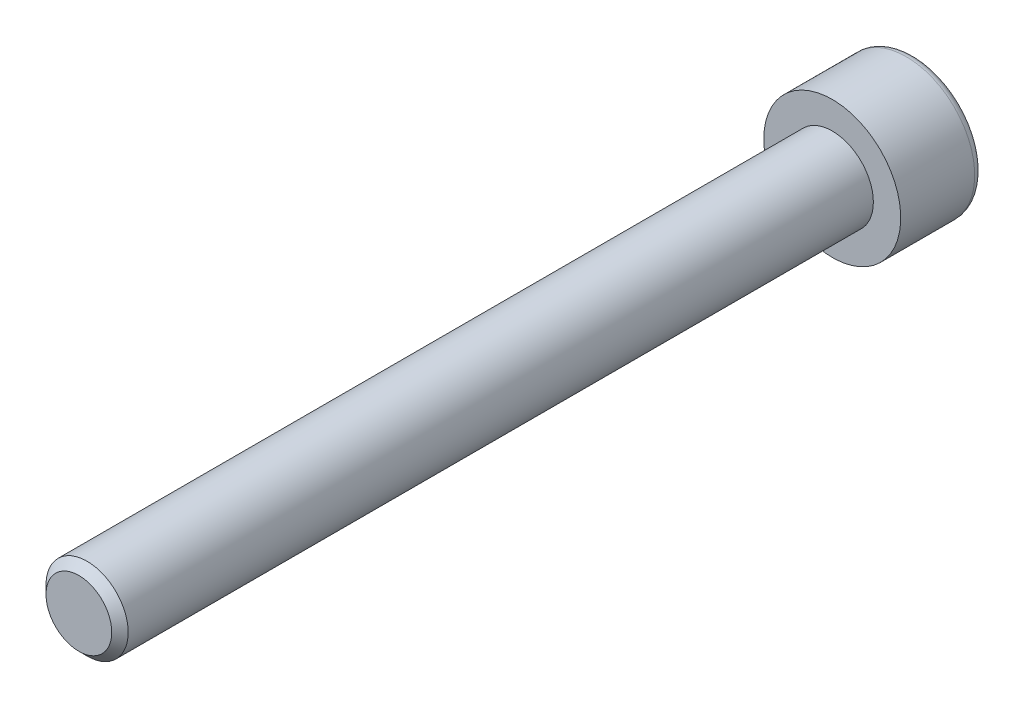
ISO-10303-21;
HEADER;
FILE_DESCRIPTION(('STEP AP214'),'2;1');
FILE_NAME('part.step','',(''),(''),'','','');
FILE_SCHEMA(('AUTOMOTIVE_DESIGN { 1 0 10303 214 1 1 1 1 }'));
ENDSEC;
DATA;
#1=APPLICATION_CONTEXT('core data for automotive mechanical design processes');
#2=APPLICATION_PROTOCOL_DEFINITION('international standard','automotive_design',2000,#1);
#3=PRODUCT_CONTEXT('',#1,'mechanical');
#4=PRODUCT('Part','Part','',(#3));
#5=PRODUCT_RELATED_PRODUCT_CATEGORY('part','',(#4));
#6=PRODUCT_DEFINITION_FORMATION('','',#4);
#7=PRODUCT_DEFINITION_CONTEXT('part definition',#1,'design');
#8=PRODUCT_DEFINITION('design','',#6,#7);
#9=PRODUCT_DEFINITION_SHAPE('','',#8);
#10=(LENGTH_UNIT() NAMED_UNIT(*) SI_UNIT(.MILLI.,.METRE.));
#11=(NAMED_UNIT(*) PLANE_ANGLE_UNIT() SI_UNIT($,.RADIAN.));
#12=(NAMED_UNIT(*) SI_UNIT($,.STERADIAN.) SOLID_ANGLE_UNIT());
#13=UNCERTAINTY_MEASURE_WITH_UNIT(LENGTH_MEASURE(1.E-05),#10,'distance_accuracy_value','');
#14=(GEOMETRIC_REPRESENTATION_CONTEXT(3) GLOBAL_UNCERTAINTY_ASSIGNED_CONTEXT((#13)) GLOBAL_UNIT_ASSIGNED_CONTEXT((#10,
#11,#12)) REPRESENTATION_CONTEXT('',''));
#15=CARTESIAN_POINT('',(0.,0.,0.));
#16=DIRECTION('',(0.,0.,1.));
#17=DIRECTION('',(1.,0.,0.));
#18=AXIS2_PLACEMENT_3D('',#15,#16,#17);
#19=CARTESIAN_POINT('',(0.,0.,-6.));
#20=DIRECTION('',(0.,0.,1.));
#21=DIRECTION('',(1.,0.,0.));
#22=AXIS2_PLACEMENT_3D('',#19,#20,#21);
#23=PLANE('',#22);
#24=CARTESIAN_POINT('',(0.,0.,-6.));
#25=DIRECTION('',(0.,0.,-1.));
#26=DIRECTION('',(-1.,0.,0.));
#27=AXIS2_PLACEMENT_3D('',#24,#25,#26);
#28=CIRCLE('',#27,4.4);
#29=CARTESIAN_POINT('',(-4.4,0.,-6.));
#30=VERTEX_POINT('',#29);
#31=EDGE_CURVE('E140',#30,#30,#28,.T.);
#32=ORIENTED_EDGE('',*,*,#31,.T.);
#33=EDGE_LOOP('',(#32));
#34=FACE_BOUND('',#33,.T.);
#35=DIRECTION('',(-0.86602540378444,0.499999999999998,0.));
#36=VECTOR('',#35,1.);
#37=CARTESIAN_POINT('',(0.,2.88675134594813,-6.));
#38=LINE('',#37,#36);
#39=CARTESIAN_POINT('',(2.5,1.44337567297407,-6.));
#40=VERTEX_POINT('',#39);
#41=CARTESIAN_POINT('',(0.,2.88675134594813,-6.));
#42=VERTEX_POINT('',#41);
#43=EDGE_CURVE('E44',#40,#42,#38,.T.);
#44=ORIENTED_EDGE('',*,*,#43,.T.);
#45=DIRECTION('',(-0.866025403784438,-0.500000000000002,0.));
#46=VECTOR('',#45,1.);
#47=CARTESIAN_POINT('',(0.,2.88675134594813,-6.));
#48=LINE('',#47,#46);
#49=CARTESIAN_POINT('',(-2.5,1.44337567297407,-6.));
#50=VERTEX_POINT('',#49);
#51=EDGE_CURVE('E84',#42,#50,#48,.T.);
#52=ORIENTED_EDGE('',*,*,#51,.T.);
#53=DIRECTION('',(0.,-1.,0.));
#54=VECTOR('',#53,1.);
#55=CARTESIAN_POINT('',(-2.5,-1.44337567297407,-6.));
#56=LINE('',#55,#54);
#57=CARTESIAN_POINT('',(-2.5,-1.44337567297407,-6.));
#58=VERTEX_POINT('',#57);
#59=EDGE_CURVE('E92',#50,#58,#56,.T.);
#60=ORIENTED_EDGE('',*,*,#59,.T.);
#61=DIRECTION('',(0.866025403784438,-0.500000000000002,0.));
#62=VECTOR('',#61,1.);
#63=CARTESIAN_POINT('',(0.,-2.88675134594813,-6.));
#64=LINE('',#63,#62);
#65=CARTESIAN_POINT('',(0.,-2.88675134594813,-6.));
#66=VERTEX_POINT('',#65);
#67=EDGE_CURVE('E110',#58,#66,#64,.T.);
#68=ORIENTED_EDGE('',*,*,#67,.T.);
#69=DIRECTION('',(0.86602540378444,0.499999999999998,0.));
#70=VECTOR('',#69,1.);
#71=CARTESIAN_POINT('',(0.,-2.88675134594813,-6.));
#72=LINE('',#71,#70);
#73=CARTESIAN_POINT('',(2.5,-1.44337567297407,-6.));
#74=VERTEX_POINT('',#73);
#75=EDGE_CURVE('E113',#66,#74,#72,.T.);
#76=ORIENTED_EDGE('',*,*,#75,.T.);
#77=DIRECTION('',(0.,1.,0.));
#78=VECTOR('',#77,1.);
#79=CARTESIAN_POINT('',(2.5,-1.44337567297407,-6.));
#80=LINE('',#79,#78);
#81=EDGE_CURVE('E103',#74,#40,#80,.T.);
#82=ORIENTED_EDGE('',*,*,#81,.T.);
#83=EDGE_LOOP('',(#44,#52,#60,#68,#76,#82));
#84=FACE_BOUND('',#83,.T.);
#85=ADVANCED_FACE('F30',(#34,#84),#23,.F.);
#86=CARTESIAN_POINT('',(0.,0.,-5.4));
#87=DIRECTION('',(0.,0.,-1.));
#88=DIRECTION('',(-1.,0.,0.));
#89=AXIS2_PLACEMENT_3D('',#86,#87,#88);
#90=TOROIDAL_SURFACE('',#89,4.4,0.600000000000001);
#91=ORIENTED_EDGE('',*,*,#31,.F.);
#92=EDGE_LOOP('',(#91));
#93=FACE_BOUND('',#92,.T.);
#94=CARTESIAN_POINT('',(0.,0.,-5.4));
#95=DIRECTION('',(0.,0.,-1.));
#96=DIRECTION('',(-1.,0.,0.));
#97=AXIS2_PLACEMENT_3D('',#94,#95,#96);
#98=CIRCLE('',#97,5.);
#99=CARTESIAN_POINT('',(-5.,0.,-5.4));
#100=VERTEX_POINT('',#99);
#101=EDGE_CURVE('E137',#100,#100,#98,.T.);
#102=ORIENTED_EDGE('',*,*,#101,.T.);
#103=EDGE_LOOP('',(#102));
#104=FACE_BOUND('',#103,.T.);
#105=ADVANCED_FACE('F159',(#93,#104),#90,.T.);
#106=CARTESIAN_POINT('',(0.,0.,0.));
#107=DIRECTION('',(0.,0.,-1.));
#108=DIRECTION('',(-1.,0.,0.));
#109=AXIS2_PLACEMENT_3D('',#106,#107,#108);
#110=CYLINDRICAL_SURFACE('',#109,5.);
#111=ORIENTED_EDGE('',*,*,#101,.F.);
#112=EDGE_LOOP('',(#111));
#113=FACE_BOUND('',#112,.T.);
#114=CARTESIAN_POINT('',(0.,0.,0.));
#115=DIRECTION('',(0.,0.,-1.));
#116=DIRECTION('',(-1.,0.,0.));
#117=AXIS2_PLACEMENT_3D('',#114,#115,#116);
#118=CIRCLE('',#117,5.);
#119=CARTESIAN_POINT('',(-5.,0.,0.));
#120=VERTEX_POINT('',#119);
#121=EDGE_CURVE('E98',#120,#120,#118,.T.);
#122=ORIENTED_EDGE('',*,*,#121,.T.);
#123=EDGE_LOOP('',(#122));
#124=FACE_BOUND('',#123,.T.);
#125=ADVANCED_FACE('F164',(#113,#124),#110,.T.);
#126=CARTESIAN_POINT('',(0.,0.,0.));
#127=DIRECTION('',(0.,0.,-1.));
#128=DIRECTION('',(-1.,0.,0.));
#129=AXIS2_PLACEMENT_3D('',#126,#127,#128);
#130=PLANE('',#129);
#131=CARTESIAN_POINT('',(0.,0.,0.));
#132=DIRECTION('',(0.,0.,1.));
#133=DIRECTION('',(1.,0.,0.));
#134=AXIS2_PLACEMENT_3D('',#131,#132,#133);
#135=CIRCLE('',#134,3.);
#136=CARTESIAN_POINT('',(3.,0.,0.));
#137=VERTEX_POINT('',#136);
#138=EDGE_CURVE('E104',#137,#137,#135,.T.);
#139=ORIENTED_EDGE('',*,*,#138,.F.);
#140=EDGE_LOOP('',(#139));
#141=FACE_BOUND('',#140,.T.);
#142=ORIENTED_EDGE('',*,*,#121,.F.);
#143=EDGE_LOOP('',(#142));
#144=FACE_BOUND('',#143,.T.);
#145=ADVANCED_FACE('F172',(#141,#144),#130,.F.);
#146=CARTESIAN_POINT('',(0.,2.88675134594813,-3.));
#147=DIRECTION('',(-0.499999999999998,-0.86602540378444,0.));
#148=DIRECTION('',(0.86602540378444,-0.499999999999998,0.));
#149=AXIS2_PLACEMENT_3D('',#146,#147,#148);
#150=PLANE('',#149);
#151=ORIENTED_EDGE('',*,*,#43,.F.);
#152=DIRECTION('',(0.,0.,-1.));
#153=VECTOR('',#152,1.);
#154=CARTESIAN_POINT('',(2.5,1.44337567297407,-3.));
#155=LINE('',#154,#153);
#156=CARTESIAN_POINT('',(2.5,1.44337567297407,-3.));
#157=VERTEX_POINT('',#156);
#158=EDGE_CURVE('E126',#157,#40,#155,.T.);
#159=ORIENTED_EDGE('',*,*,#158,.F.);
#160=DIRECTION('',(-0.86602540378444,0.499999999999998,0.));
#161=VECTOR('',#160,1.);
#162=CARTESIAN_POINT('',(0.,2.88675134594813,-3.));
#163=LINE('',#162,#161);
#164=CARTESIAN_POINT('',(0.,2.88675134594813,-3.));
#165=VERTEX_POINT('',#164);
#166=EDGE_CURVE('E97',#157,#165,#163,.T.);
#167=ORIENTED_EDGE('',*,*,#166,.T.);
#168=DIRECTION('',(0.,0.,-1.));
#169=VECTOR('',#168,1.);
#170=CARTESIAN_POINT('',(0.,2.88675134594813,-3.));
#171=LINE('',#170,#169);
#172=EDGE_CURVE('E86',#165,#42,#171,.T.);
#173=ORIENTED_EDGE('',*,*,#172,.T.);
#174=EDGE_LOOP('',(#151,#159,#167,#173));
#175=FACE_BOUND('',#174,.T.);
#176=ADVANCED_FACE('F95',(#175),#150,.T.);
#177=CARTESIAN_POINT('',(0.,2.88675134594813,-3.));
#178=DIRECTION('',(0.500000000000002,-0.866025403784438,0.));
#179=DIRECTION('',(0.866025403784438,0.500000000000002,0.));
#180=AXIS2_PLACEMENT_3D('',#177,#178,#179);
#181=PLANE('',#180);
#182=ORIENTED_EDGE('',*,*,#51,.F.);
#183=ORIENTED_EDGE('',*,*,#172,.F.);
#184=DIRECTION('',(-0.866025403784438,-0.500000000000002,0.));
#185=VECTOR('',#184,1.);
#186=CARTESIAN_POINT('',(0.,2.88675134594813,-3.));
#187=LINE('',#186,#185);
#188=CARTESIAN_POINT('',(-2.5,1.44337567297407,-3.));
#189=VERTEX_POINT('',#188);
#190=EDGE_CURVE('E117',#165,#189,#187,.T.);
#191=ORIENTED_EDGE('',*,*,#190,.T.);
#192=DIRECTION('',(0.,0.,-1.));
#193=VECTOR('',#192,1.);
#194=CARTESIAN_POINT('',(-2.5,1.44337567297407,-3.));
#195=LINE('',#194,#193);
#196=EDGE_CURVE('E88',#189,#50,#195,.T.);
#197=ORIENTED_EDGE('',*,*,#196,.T.);
#198=EDGE_LOOP('',(#182,#183,#191,#197));
#199=FACE_BOUND('',#198,.T.);
#200=ADVANCED_FACE('F85',(#199),#181,.T.);
#201=CARTESIAN_POINT('',(-2.5,-1.44337567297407,-3.));
#202=DIRECTION('',(1.,0.,0.));
#203=DIRECTION('',(0.,0.,-1.));
#204=AXIS2_PLACEMENT_3D('',#201,#202,#203);
#205=PLANE('',#204);
#206=ORIENTED_EDGE('',*,*,#59,.F.);
#207=ORIENTED_EDGE('',*,*,#196,.F.);
#208=DIRECTION('',(0.,-1.,0.));
#209=VECTOR('',#208,1.);
#210=CARTESIAN_POINT('',(-2.5,-1.44337567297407,-3.));
#211=LINE('',#210,#209);
#212=CARTESIAN_POINT('',(-2.5,-1.44337567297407,-3.));
#213=VERTEX_POINT('',#212);
#214=EDGE_CURVE('E119',#189,#213,#211,.T.);
#215=ORIENTED_EDGE('',*,*,#214,.T.);
#216=DIRECTION('',(0.,0.,-1.));
#217=VECTOR('',#216,1.);
#218=CARTESIAN_POINT('',(-2.5,-1.44337567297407,-3.));
#219=LINE('',#218,#217);
#220=EDGE_CURVE('E132',#213,#58,#219,.T.);
#221=ORIENTED_EDGE('',*,*,#220,.T.);
#222=EDGE_LOOP('',(#206,#207,#215,#221));
#223=FACE_BOUND('',#222,.T.);
#224=ADVANCED_FACE('F187',(#223),#205,.T.);
#225=CARTESIAN_POINT('',(0.,-2.88675134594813,-3.));
#226=DIRECTION('',(0.500000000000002,0.866025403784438,0.));
#227=DIRECTION('',(-0.866025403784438,0.500000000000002,0.));
#228=AXIS2_PLACEMENT_3D('',#225,#226,#227);
#229=PLANE('',#228);
#230=ORIENTED_EDGE('',*,*,#67,.F.);
#231=ORIENTED_EDGE('',*,*,#220,.F.);
#232=DIRECTION('',(0.866025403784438,-0.500000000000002,0.));
#233=VECTOR('',#232,1.);
#234=CARTESIAN_POINT('',(0.,-2.88675134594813,-3.));
#235=LINE('',#234,#233);
#236=CARTESIAN_POINT('',(0.,-2.88675134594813,-3.));
#237=VERTEX_POINT('',#236);
#238=EDGE_CURVE('E121',#213,#237,#235,.T.);
#239=ORIENTED_EDGE('',*,*,#238,.T.);
#240=DIRECTION('',(0.,0.,-1.));
#241=VECTOR('',#240,1.);
#242=CARTESIAN_POINT('',(0.,-2.88675134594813,-3.));
#243=LINE('',#242,#241);
#244=EDGE_CURVE('E130',#237,#66,#243,.T.);
#245=ORIENTED_EDGE('',*,*,#244,.T.);
#246=EDGE_LOOP('',(#230,#231,#239,#245));
#247=FACE_BOUND('',#246,.T.);
#248=ADVANCED_FACE('F190',(#247),#229,.T.);
#249=CARTESIAN_POINT('',(0.,-2.88675134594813,-3.));
#250=DIRECTION('',(-0.499999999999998,0.86602540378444,0.));
#251=DIRECTION('',(-0.86602540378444,-0.499999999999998,0.));
#252=AXIS2_PLACEMENT_3D('',#249,#250,#251);
#253=PLANE('',#252);
#254=ORIENTED_EDGE('',*,*,#75,.F.);
#255=ORIENTED_EDGE('',*,*,#244,.F.);
#256=DIRECTION('',(0.86602540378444,0.499999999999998,0.));
#257=VECTOR('',#256,1.);
#258=CARTESIAN_POINT('',(0.,-2.88675134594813,-3.));
#259=LINE('',#258,#257);
#260=CARTESIAN_POINT('',(2.5,-1.44337567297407,-3.));
#261=VERTEX_POINT('',#260);
#262=EDGE_CURVE('E123',#237,#261,#259,.T.);
#263=ORIENTED_EDGE('',*,*,#262,.T.);
#264=DIRECTION('',(0.,0.,-1.));
#265=VECTOR('',#264,1.);
#266=CARTESIAN_POINT('',(2.5,-1.44337567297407,-3.));
#267=LINE('',#266,#265);
#268=EDGE_CURVE('E128',#261,#74,#267,.T.);
#269=ORIENTED_EDGE('',*,*,#268,.T.);
#270=EDGE_LOOP('',(#254,#255,#263,#269));
#271=FACE_BOUND('',#270,.T.);
#272=ADVANCED_FACE('F194',(#271),#253,.T.);
#273=CARTESIAN_POINT('',(2.5,-1.44337567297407,-3.));
#274=DIRECTION('',(-1.,0.,0.));
#275=DIRECTION('',(0.,0.,1.));
#276=AXIS2_PLACEMENT_3D('',#273,#274,#275);
#277=PLANE('',#276);
#278=ORIENTED_EDGE('',*,*,#81,.F.);
#279=ORIENTED_EDGE('',*,*,#268,.F.);
#280=DIRECTION('',(0.,1.,0.));
#281=VECTOR('',#280,1.);
#282=CARTESIAN_POINT('',(2.5,-1.44337567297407,-3.));
#283=LINE('',#282,#281);
#284=EDGE_CURVE('E51',#261,#157,#283,.T.);
#285=ORIENTED_EDGE('',*,*,#284,.T.);
#286=ORIENTED_EDGE('',*,*,#158,.T.);
#287=EDGE_LOOP('',(#278,#279,#285,#286));
#288=FACE_BOUND('',#287,.T.);
#289=ADVANCED_FACE('F198',(#288),#277,.T.);
#290=CARTESIAN_POINT('',(2.5,1.44337567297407,-3.));
#291=DIRECTION('',(0.,0.,1.));
#292=DIRECTION('',(1.,0.,0.));
#293=AXIS2_PLACEMENT_3D('',#290,#291,#292);
#294=PLANE('',#293);
#295=ORIENTED_EDGE('',*,*,#166,.F.);
#296=ORIENTED_EDGE('',*,*,#284,.F.);
#297=ORIENTED_EDGE('',*,*,#262,.F.);
#298=ORIENTED_EDGE('',*,*,#238,.F.);
#299=ORIENTED_EDGE('',*,*,#214,.F.);
#300=ORIENTED_EDGE('',*,*,#190,.F.);
#301=EDGE_LOOP('',(#295,#296,#297,#298,#299,#300));
#302=FACE_BOUND('',#301,.T.);
#303=ADVANCED_FACE('F202',(#302),#294,.F.);
#304=CARTESIAN_POINT('',(0.,0.,55.));
#305=DIRECTION('',(0.,0.,1.));
#306=DIRECTION('',(1.,0.,0.));
#307=AXIS2_PLACEMENT_3D('',#304,#305,#306);
#308=PLANE('',#307);
#309=CARTESIAN_POINT('',(0.,0.,55.));
#310=DIRECTION('',(0.,0.,1.));
#311=DIRECTION('',(1.,0.,0.));
#312=AXIS2_PLACEMENT_3D('',#309,#310,#311);
#313=CIRCLE('',#312,2.4);
#314=CARTESIAN_POINT('',(2.40000000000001,0.,55.));
#315=VERTEX_POINT('',#314);
#316=EDGE_CURVE('E37',#315,#315,#313,.T.);
#317=ORIENTED_EDGE('',*,*,#316,.T.);
#318=EDGE_LOOP('',(#317));
#319=FACE_BOUND('',#318,.T.);
#320=ADVANCED_FACE('F145',(#319),#308,.T.);
#321=CARTESIAN_POINT('',(0.,0.,0.));
#322=DIRECTION('',(0.,0.,1.));
#323=DIRECTION('',(1.,0.,0.));
#324=AXIS2_PLACEMENT_3D('',#321,#322,#323);
#325=CYLINDRICAL_SURFACE('',#324,3.);
#326=CARTESIAN_POINT('',(0.,0.,54.4));
#327=DIRECTION('',(0.,0.,1.));
#328=DIRECTION('',(1.,0.,0.));
#329=AXIS2_PLACEMENT_3D('',#326,#327,#328);
#330=CIRCLE('',#329,3.);
#331=CARTESIAN_POINT('',(3.00000000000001,0.,54.4));
#332=VERTEX_POINT('',#331);
#333=EDGE_CURVE('E11',#332,#332,#330,.F.);
#334=ORIENTED_EDGE('',*,*,#333,.T.);
#335=EDGE_LOOP('',(#334));
#336=FACE_BOUND('',#335,.T.);
#337=ORIENTED_EDGE('',*,*,#138,.T.);
#338=EDGE_LOOP('',(#337));
#339=FACE_BOUND('',#338,.T.);
#340=ADVANCED_FACE('F149',(#336,#339),#325,.T.);
#341=CARTESIAN_POINT('',(0.,0.,55.));
#342=DIRECTION('',(0.,0.,-1.));
#343=DIRECTION('',(-1.,0.,0.));
#344=AXIS2_PLACEMENT_3D('',#341,#342,#343);
#345=CONICAL_SURFACE('',#344,2.4,0.785398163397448);
#346=ORIENTED_EDGE('',*,*,#333,.F.);
#347=EDGE_LOOP('',(#346));
#348=FACE_BOUND('',#347,.T.);
#349=ORIENTED_EDGE('',*,*,#316,.F.);
#350=EDGE_LOOP('',(#349));
#351=FACE_BOUND('',#350,.T.);
#352=ADVANCED_FACE('F147',(#348,#351),#345,.T.);
#353=CLOSED_SHELL('',(#85,#105,#125,#145,#176,#200,#224,#248,#272,#289,#303,#320,#340,#352));
#354=MANIFOLD_SOLID_BREP('B2',#353);
#355=ADVANCED_BREP_SHAPE_REPRESENTATION('',(#18,#354),#14);
#356=SHAPE_DEFINITION_REPRESENTATION(#9,#355);
ENDSEC;
END-ISO-10303-21;
